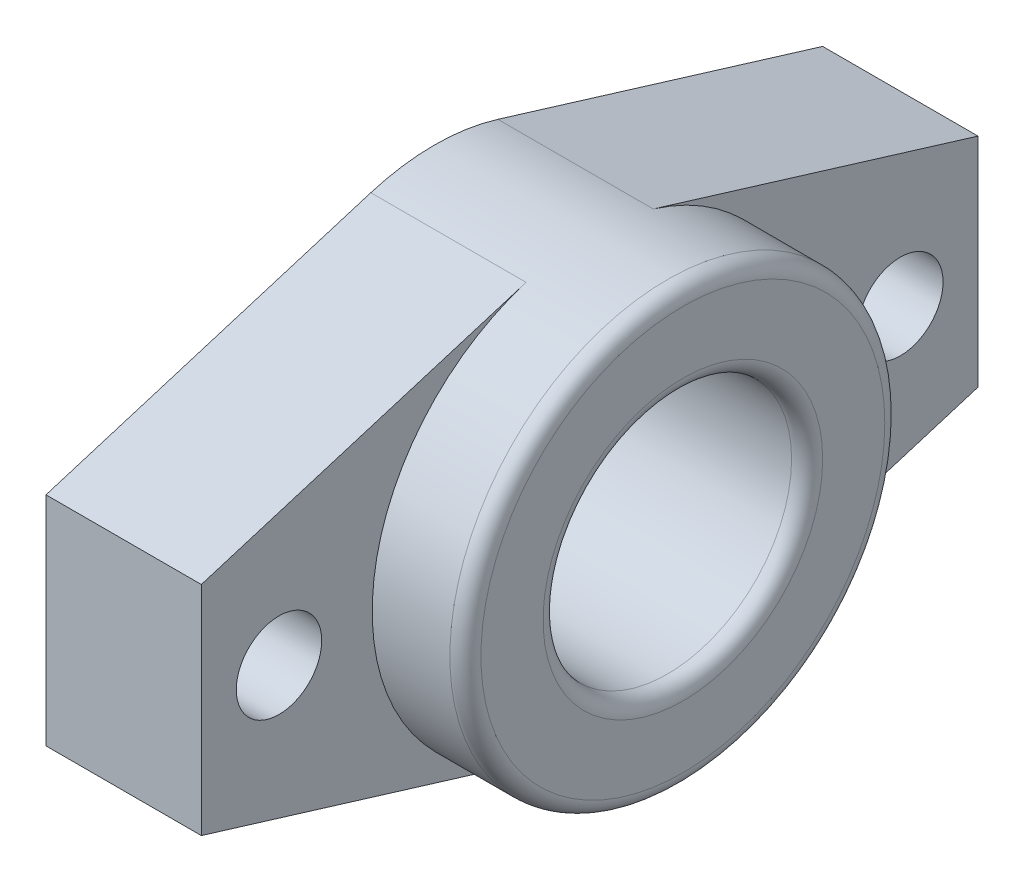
from build123d import *

# Parameters (mm, degrees)
BOSS_EXTRUDE1_DEPTH = 10
SKETCH3_R           = 14
BOSS_EXTRUDE2_DEPTH = 6
SKETCH4_R           = 2.75
SKETCH4_R_2         = 8
CUT_EXTRUDE1_DEPTH  = 16
FILLET1_R           = 1


with BuildPart() as part:
    # Sketch2 → Boss-Extrude1 (new body)
    with BuildSketch(Plane(origin=(0, 0, 0), x_dir=(0, 0, -1), z_dir=(1, 0, 0))):
        with BuildLine():
            Line((50, 7), (29.091106, 0.611092))
            ThreePointArc((29.091106, 0.611092), (25, 0), (20.908894, 0.611092))
            Line((20.908894, 0.611092), (0, 7))
            Line((0, 7), (0, 21))
            Line((0, 21), (20.908894, 27.388908))
            ThreePointArc((20.908894, 27.388908), (25, 28), (29.091106, 27.388908))
            Line((29.091106, 27.388908), (50, 21))
            Line((50, 21), (50, 7))
        make_face()
    extrude(amount=BOSS_EXTRUDE1_DEPTH)

    # Sketch3 → Boss-Extrude2 (add)
    with BuildSketch(Plane(origin=(10, 0, 0), x_dir=(0, 0, -1), z_dir=(1, 0, 0))):
        with Locations(Location((25, 14, 0), (0, 0, 253.008979))):
            Circle(SKETCH3_R)
    extrude(amount=BOSS_EXTRUDE2_DEPTH)

    # Sketch4 → Cut-Extrude1 (cut)
    with BuildSketch(Plane.ZY):
        with Locations((-45, 14)):
            Circle(SKETCH4_R)
        with Locations((-25, 14)):
            Circle(SKETCH4_R_2)
        with Locations((-5, 14)):
            Circle(SKETCH4_R)
    extrude(amount=-CUT_EXTRUDE1_DEPTH, mode=Mode.SUBTRACT)

    # Fillet1
    fillet1_edges = [part.edges().sort_by_distance(p)[0] for p in [
        (16, 27.388908, -29.091106),
        (16, 14, -33),
    ]]
    fillet(fillet1_edges, radius=FILLET1_R)


solid = part.part
